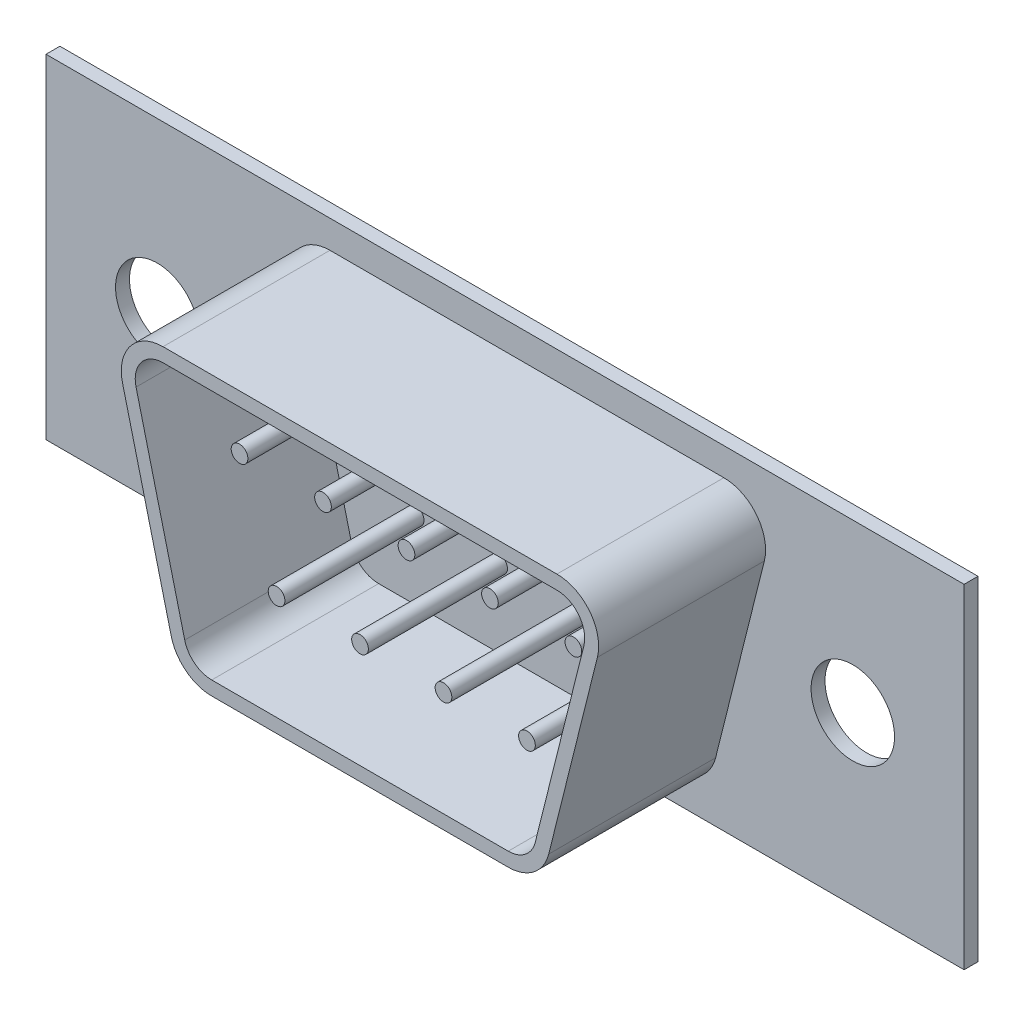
ISO-10303-21;
HEADER;
FILE_DESCRIPTION(('STEP AP214'),'2;1');
FILE_NAME('part.step','',(''),(''),'','','');
FILE_SCHEMA(('AUTOMOTIVE_DESIGN { 1 0 10303 214 1 1 1 1 }'));
ENDSEC;
DATA;
#1=APPLICATION_CONTEXT('core data for automotive mechanical design processes');
#2=APPLICATION_PROTOCOL_DEFINITION('international standard','automotive_design',2000,#1);
#3=PRODUCT_CONTEXT('',#1,'mechanical');
#4=PRODUCT('Part','Part','',(#3));
#5=PRODUCT_RELATED_PRODUCT_CATEGORY('part','',(#4));
#6=PRODUCT_DEFINITION_FORMATION('','',#4);
#7=PRODUCT_DEFINITION_CONTEXT('part definition',#1,'design');
#8=PRODUCT_DEFINITION('design','',#6,#7);
#9=PRODUCT_DEFINITION_SHAPE('','',#8);
#10=(LENGTH_UNIT() NAMED_UNIT(*) SI_UNIT(.MILLI.,.METRE.));
#11=(NAMED_UNIT(*) PLANE_ANGLE_UNIT() SI_UNIT($,.RADIAN.));
#12=(NAMED_UNIT(*) SI_UNIT($,.STERADIAN.) SOLID_ANGLE_UNIT());
#13=UNCERTAINTY_MEASURE_WITH_UNIT(LENGTH_MEASURE(1.E-05),#10,'distance_accuracy_value','');
#14=(GEOMETRIC_REPRESENTATION_CONTEXT(3) GLOBAL_UNCERTAINTY_ASSIGNED_CONTEXT((#13)) GLOBAL_UNIT_ASSIGNED_CONTEXT((#10,
#11,#12)) REPRESENTATION_CONTEXT('',''));
#15=CARTESIAN_POINT('',(0.,0.,0.));
#16=DIRECTION('',(0.,0.,1.));
#17=DIRECTION('',(1.,0.,0.));
#18=AXIS2_PLACEMENT_3D('',#15,#16,#17);
#19=CARTESIAN_POINT('',(16.5,6.,0.5));
#20=DIRECTION('',(0.,0.,-1.));
#21=DIRECTION('',(-1.,0.,0.));
#22=AXIS2_PLACEMENT_3D('',#19,#20,#21);
#23=PLANE('',#22);
#24=CARTESIAN_POINT('',(2.78768063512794,-1.72088537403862,0.5));
#25=DIRECTION('',(0.,0.,-1.));
#26=DIRECTION('',(-1.,0.,0.));
#27=AXIS2_PLACEMENT_3D('',#24,#25,#26);
#28=CIRCLE('',#27,0.3);
#29=CARTESIAN_POINT('',(2.48768063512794,-1.72088537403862,0.5));
#30=VERTEX_POINT('',#29);
#31=EDGE_CURVE('E39',#30,#30,#28,.F.);
#32=ORIENTED_EDGE('',*,*,#31,.F.);
#33=EDGE_LOOP('',(#32));
#34=FACE_BOUND('',#33,.T.);
#35=CARTESIAN_POINT('',(-3.21231936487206,-1.72088537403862,0.5));
#36=DIRECTION('',(0.,0.,-1.));
#37=DIRECTION('',(-1.,0.,0.));
#38=AXIS2_PLACEMENT_3D('',#35,#36,#37);
#39=CIRCLE('',#38,0.3);
#40=CARTESIAN_POINT('',(-3.51231936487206,-1.72088537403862,0.5));
#41=VERTEX_POINT('',#40);
#42=EDGE_CURVE('E286',#41,#41,#39,.F.);
#43=ORIENTED_EDGE('',*,*,#42,.F.);
#44=EDGE_LOOP('',(#43));
#45=FACE_BOUND('',#44,.T.);
#46=CARTESIAN_POINT('',(4.45686261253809,2.04211731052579,0.5));
#47=DIRECTION('',(0.,0.,-1.));
#48=DIRECTION('',(-1.,0.,0.));
#49=AXIS2_PLACEMENT_3D('',#46,#47,#48);
#50=CIRCLE('',#49,0.3);
#51=CARTESIAN_POINT('',(4.15686261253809,2.04211731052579,0.5));
#52=VERTEX_POINT('',#51);
#53=EDGE_CURVE('E280',#52,#52,#50,.F.);
#54=ORIENTED_EDGE('',*,*,#53,.F.);
#55=EDGE_LOOP('',(#54));
#56=FACE_BOUND('',#55,.T.);
#57=CARTESIAN_POINT('',(-1.54313738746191,2.04211731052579,0.5));
#58=DIRECTION('',(0.,0.,-1.));
#59=DIRECTION('',(-1.,0.,0.));
#60=AXIS2_PLACEMENT_3D('',#57,#58,#59);
#61=CIRCLE('',#60,0.3);
#62=CARTESIAN_POINT('',(-1.84313738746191,2.04211731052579,0.5));
#63=VERTEX_POINT('',#62);
#64=EDGE_CURVE('E274',#63,#63,#61,.F.);
#65=ORIENTED_EDGE('',*,*,#64,.F.);
#66=EDGE_LOOP('',(#65));
#67=FACE_BOUND('',#66,.T.);
#68=DIRECTION('',(0.242535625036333,0.970142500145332,0.));
#69=VECTOR('',#68,1.);
#70=CARTESIAN_POINT('',(9.14525227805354,4.5,0.5));
#71=LINE('',#70,#69);
#72=CARTESIAN_POINT('',(7.08461837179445,-3.74253562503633,0.5));
#73=VERTEX_POINT('',#72);
#74=CARTESIAN_POINT('',(8.83461837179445,3.25746437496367,0.5));
#75=VERTEX_POINT('',#74);
#76=EDGE_CURVE('E308',#73,#75,#71,.T.);
#77=ORIENTED_EDGE('',*,*,#76,.T.);
#78=CARTESIAN_POINT('',(7.86447587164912,3.5,0.5));
#79=DIRECTION('',(0.,0.,-1.));
#80=DIRECTION('',(-1.,0.,0.));
#81=AXIS2_PLACEMENT_3D('',#78,#79,#80);
#82=CIRCLE('',#81,1.);
#83=CARTESIAN_POINT('',(7.86447587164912,4.5,0.5));
#84=VERTEX_POINT('',#83);
#85=EDGE_CURVE('E227',#75,#84,#82,.F.);
#86=ORIENTED_EDGE('',*,*,#85,.T.);
#87=DIRECTION('',(-1.,0.,0.));
#88=VECTOR('',#87,1.);
#89=CARTESIAN_POINT('',(-7.57397131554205,4.5,0.5));
#90=LINE('',#89,#88);
#91=CARTESIAN_POINT('',(-6.29319490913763,4.5,0.5));
#92=VERTEX_POINT('',#91);
#93=EDGE_CURVE('E835',#84,#92,#90,.T.);
#94=ORIENTED_EDGE('',*,*,#93,.T.);
#95=CARTESIAN_POINT('',(-6.29319490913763,3.5,0.5));
#96=DIRECTION('',(0.,0.,-1.));
#97=DIRECTION('',(-1.,0.,0.));
#98=AXIS2_PLACEMENT_3D('',#95,#96,#97);
#99=CIRCLE('',#98,1.);
#100=CARTESIAN_POINT('',(-7.26333740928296,3.25746437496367,0.5));
#101=VERTEX_POINT('',#100);
#102=EDGE_CURVE('E206',#92,#101,#99,.F.);
#103=ORIENTED_EDGE('',*,*,#102,.T.);
#104=DIRECTION('',(0.242535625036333,-0.970142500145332,0.));
#105=VECTOR('',#104,1.);
#106=CARTESIAN_POINT('',(-5.32397131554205,-4.5,0.5));
#107=LINE('',#106,#105);
#108=CARTESIAN_POINT('',(-5.51333740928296,-3.74253562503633,0.5));
#109=VERTEX_POINT('',#108);
#110=EDGE_CURVE('E836',#101,#109,#107,.T.);
#111=ORIENTED_EDGE('',*,*,#110,.T.);
#112=CARTESIAN_POINT('',(-4.54319490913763,-3.5,0.5));
#113=DIRECTION('',(0.,0.,-1.));
#114=DIRECTION('',(-1.,0.,0.));
#115=AXIS2_PLACEMENT_3D('',#112,#113,#114);
#116=CIRCLE('',#115,1.);
#117=CARTESIAN_POINT('',(-4.54319490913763,-4.5,0.5));
#118=VERTEX_POINT('',#117);
#119=EDGE_CURVE('E199',#109,#118,#116,.F.);
#120=ORIENTED_EDGE('',*,*,#119,.T.);
#121=DIRECTION('',(1.,0.,0.));
#122=VECTOR('',#121,1.);
#123=CARTESIAN_POINT('',(6.89525227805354,-4.5,0.5));
#124=LINE('',#123,#122);
#125=CARTESIAN_POINT('',(6.11447587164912,-4.5,0.5));
#126=VERTEX_POINT('',#125);
#127=EDGE_CURVE('E830',#118,#126,#124,.T.);
#128=ORIENTED_EDGE('',*,*,#127,.T.);
#129=CARTESIAN_POINT('',(6.11447587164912,-3.5,0.5));
#130=DIRECTION('',(0.,0.,-1.));
#131=DIRECTION('',(-1.,0.,0.));
#132=AXIS2_PLACEMENT_3D('',#129,#130,#131);
#133=CIRCLE('',#132,1.);
#134=EDGE_CURVE('E225',#126,#73,#133,.F.);
#135=ORIENTED_EDGE('',*,*,#134,.T.);
#136=EDGE_LOOP('',(#77,#86,#94,#103,#111,#120,#128,#135));
#137=FACE_BOUND('',#136,.T.);
#138=CARTESIAN_POINT('',(-4.54313738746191,2.04211731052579,0.5));
#139=DIRECTION('',(0.,0.,-1.));
#140=DIRECTION('',(-1.,0.,0.));
#141=AXIS2_PLACEMENT_3D('',#138,#139,#140);
#142=CIRCLE('',#141,0.3);
#143=CARTESIAN_POINT('',(-4.84313738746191,2.04211731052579,0.5));
#144=VERTEX_POINT('',#143);
#145=EDGE_CURVE('E271',#144,#144,#142,.F.);
#146=ORIENTED_EDGE('',*,*,#145,.F.);
#147=EDGE_LOOP('',(#146));
#148=FACE_BOUND('',#147,.T.);
#149=CARTESIAN_POINT('',(1.45686261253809,2.04211731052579,0.5));
#150=DIRECTION('',(0.,0.,-1.));
#151=DIRECTION('',(-1.,0.,0.));
#152=AXIS2_PLACEMENT_3D('',#149,#150,#151);
#153=CIRCLE('',#152,0.3);
#154=CARTESIAN_POINT('',(1.15686261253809,2.04211731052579,0.5));
#155=VERTEX_POINT('',#154);
#156=EDGE_CURVE('E277',#155,#155,#153,.F.);
#157=ORIENTED_EDGE('',*,*,#156,.F.);
#158=EDGE_LOOP('',(#157));
#159=FACE_BOUND('',#158,.T.);
#160=CARTESIAN_POINT('',(7.45686261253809,2.04211731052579,0.5));
#161=DIRECTION('',(0.,0.,-1.));
#162=DIRECTION('',(-1.,0.,0.));
#163=AXIS2_PLACEMENT_3D('',#160,#161,#162);
#164=CIRCLE('',#163,0.3);
#165=CARTESIAN_POINT('',(7.15686261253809,2.04211731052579,0.5));
#166=VERTEX_POINT('',#165);
#167=EDGE_CURVE('E283',#166,#166,#164,.F.);
#168=ORIENTED_EDGE('',*,*,#167,.F.);
#169=EDGE_LOOP('',(#168));
#170=FACE_BOUND('',#169,.T.);
#171=CARTESIAN_POINT('',(-0.212319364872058,-1.72088537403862,0.5));
#172=DIRECTION('',(0.,0.,-1.));
#173=DIRECTION('',(-1.,0.,0.));
#174=AXIS2_PLACEMENT_3D('',#171,#172,#173);
#175=CIRCLE('',#174,0.3);
#176=CARTESIAN_POINT('',(-0.512319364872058,-1.72088537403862,0.5));
#177=VERTEX_POINT('',#176);
#178=EDGE_CURVE('E289',#177,#177,#175,.F.);
#179=ORIENTED_EDGE('',*,*,#178,.F.);
#180=EDGE_LOOP('',(#179));
#181=FACE_BOUND('',#180,.T.);
#182=CARTESIAN_POINT('',(5.78768063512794,-1.72088537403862,0.5));
#183=DIRECTION('',(0.,0.,-1.));
#184=DIRECTION('',(-1.,0.,0.));
#185=AXIS2_PLACEMENT_3D('',#182,#183,#184);
#186=CIRCLE('',#185,0.3);
#187=CARTESIAN_POINT('',(5.48768063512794,-1.72088537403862,0.5));
#188=VERTEX_POINT('',#187);
#189=EDGE_CURVE('E11',#188,#188,#186,.F.);
#190=ORIENTED_EDGE('',*,*,#189,.F.);
#191=EDGE_LOOP('',(#190));
#192=FACE_BOUND('',#191,.T.);
#193=ADVANCED_FACE('F31',(#34,#45,#56,#67,#137,#148,#159,#170,#181,#192),#23,.F.);
#194=CARTESIAN_POINT('',(-12.5,0.,0.5));
#195=DIRECTION('',(0.,0.,1.));
#196=DIRECTION('',(1.,0.,0.));
#197=AXIS2_PLACEMENT_3D('',#194,#195,#196);
#198=CIRCLE('',#197,1.5);
#199=CARTESIAN_POINT('',(-11.,0.,0.5));
#200=VERTEX_POINT('',#199);
#201=EDGE_CURVE('E524',#200,#200,#198,.T.);
#202=ORIENTED_EDGE('',*,*,#201,.F.);
#203=EDGE_LOOP('',(#202));
#204=FACE_BOUND('',#203,.T.);
#205=DIRECTION('',(0.,1.,0.));
#206=VECTOR('',#205,1.);
#207=CARTESIAN_POINT('',(16.5,-6.,0.5));
#208=LINE('',#207,#206);
#209=CARTESIAN_POINT('',(16.5,-6.,0.5));
#210=VERTEX_POINT('',#209);
#211=CARTESIAN_POINT('',(16.5,6.,0.5));
#212=VERTEX_POINT('',#211);
#213=EDGE_CURVE('E181',#210,#212,#208,.T.);
#214=ORIENTED_EDGE('',*,*,#213,.T.);
#215=DIRECTION('',(-1.,0.,0.));
#216=VECTOR('',#215,1.);
#217=CARTESIAN_POINT('',(-16.5,6.,0.5));
#218=LINE('',#217,#216);
#219=CARTESIAN_POINT('',(-16.5,6.,0.5));
#220=VERTEX_POINT('',#219);
#221=EDGE_CURVE('E170',#212,#220,#218,.T.);
#222=ORIENTED_EDGE('',*,*,#221,.T.);
#223=DIRECTION('',(0.,-1.,0.));
#224=VECTOR('',#223,1.);
#225=CARTESIAN_POINT('',(-16.5,-6.,0.5));
#226=LINE('',#225,#224);
#227=CARTESIAN_POINT('',(-16.5,-6.,0.5));
#228=VERTEX_POINT('',#227);
#229=EDGE_CURVE('E180',#220,#228,#226,.T.);
#230=ORIENTED_EDGE('',*,*,#229,.T.);
#231=DIRECTION('',(1.,0.,0.));
#232=VECTOR('',#231,1.);
#233=CARTESIAN_POINT('',(-16.5,-6.,0.5));
#234=LINE('',#233,#232);
#235=EDGE_CURVE('E187',#228,#210,#234,.T.);
#236=ORIENTED_EDGE('',*,*,#235,.T.);
#237=EDGE_LOOP('',(#214,#222,#230,#236));
#238=FACE_BOUND('',#237,.T.);
#239=CARTESIAN_POINT('',(12.5,0.,0.5));
#240=DIRECTION('',(0.,0.,1.));
#241=DIRECTION('',(1.,0.,0.));
#242=AXIS2_PLACEMENT_3D('',#239,#240,#241);
#243=CIRCLE('',#242,1.5);
#244=CARTESIAN_POINT('',(14.,0.,0.5));
#245=VERTEX_POINT('',#244);
#246=EDGE_CURVE('E518',#245,#245,#243,.T.);
#247=ORIENTED_EDGE('',*,*,#246,.F.);
#248=EDGE_LOOP('',(#247));
#249=FACE_BOUND('',#248,.T.);
#250=DIRECTION('',(0.242535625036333,-0.970142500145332,0.));
#251=VECTOR('',#250,1.);
#252=CARTESIAN_POINT('',(-5.71435951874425,-5.,0.5));
#253=LINE('',#252,#251);
#254=CARTESIAN_POINT('',(-7.74840865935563,3.1361965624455,0.5));
#255=VERTEX_POINT('',#254);
#256=CARTESIAN_POINT('',(-5.99840865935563,-3.8638034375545,0.5));
#257=VERTEX_POINT('',#256);
#258=EDGE_CURVE('E508',#255,#257,#253,.T.);
#259=ORIENTED_EDGE('',*,*,#258,.F.);
#260=CARTESIAN_POINT('',(-6.29319490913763,3.5,0.5));
#261=DIRECTION('',(0.,0.,-1.));
#262=DIRECTION('',(-1.,0.,0.));
#263=AXIS2_PLACEMENT_3D('',#260,#261,#262);
#264=CIRCLE('',#263,1.5);
#265=CARTESIAN_POINT('',(-6.29319490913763,5.,0.5));
#266=VERTEX_POINT('',#265);
#267=EDGE_CURVE('E54',#255,#266,#264,.T.);
#268=ORIENTED_EDGE('',*,*,#267,.T.);
#269=DIRECTION('',(-1.,0.,0.));
#270=VECTOR('',#269,1.);
#271=CARTESIAN_POINT('',(-8.21435951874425,5.,0.5));
#272=LINE('',#271,#270);
#273=CARTESIAN_POINT('',(7.86447587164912,5.,0.5));
#274=VERTEX_POINT('',#273);
#275=EDGE_CURVE('E501',#274,#266,#272,.T.);
#276=ORIENTED_EDGE('',*,*,#275,.F.);
#277=CARTESIAN_POINT('',(7.86447587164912,3.5,0.5));
#278=DIRECTION('',(0.,0.,-1.));
#279=DIRECTION('',(-1.,0.,0.));
#280=AXIS2_PLACEMENT_3D('',#277,#278,#279);
#281=CIRCLE('',#280,1.5);
#282=CARTESIAN_POINT('',(9.31968962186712,3.1361965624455,0.5));
#283=VERTEX_POINT('',#282);
#284=EDGE_CURVE('E265',#274,#283,#281,.T.);
#285=ORIENTED_EDGE('',*,*,#284,.T.);
#286=DIRECTION('',(0.242535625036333,0.970142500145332,0.));
#287=VECTOR('',#286,1.);
#288=CARTESIAN_POINT('',(9.78564048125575,5.,0.5));
#289=LINE('',#288,#287);
#290=CARTESIAN_POINT('',(7.56968962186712,-3.8638034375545,0.5));
#291=VERTEX_POINT('',#290);
#292=EDGE_CURVE('E513',#291,#283,#289,.T.);
#293=ORIENTED_EDGE('',*,*,#292,.F.);
#294=CARTESIAN_POINT('',(6.11447587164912,-3.5,0.5));
#295=DIRECTION('',(0.,0.,-1.));
#296=DIRECTION('',(-1.,0.,0.));
#297=AXIS2_PLACEMENT_3D('',#294,#295,#296);
#298=CIRCLE('',#297,1.5);
#299=CARTESIAN_POINT('',(6.11447587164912,-5.,0.5));
#300=VERTEX_POINT('',#299);
#301=EDGE_CURVE('E267',#291,#300,#298,.T.);
#302=ORIENTED_EDGE('',*,*,#301,.T.);
#303=DIRECTION('',(1.,0.,0.));
#304=VECTOR('',#303,1.);
#305=CARTESIAN_POINT('',(7.28564048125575,-5.,0.5));
#306=LINE('',#305,#304);
#307=CARTESIAN_POINT('',(-4.54319490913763,-5.,0.5));
#308=VERTEX_POINT('',#307);
#309=EDGE_CURVE('E510',#308,#300,#306,.T.);
#310=ORIENTED_EDGE('',*,*,#309,.F.);
#311=CARTESIAN_POINT('',(-4.54319490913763,-3.5,0.5));
#312=DIRECTION('',(0.,0.,-1.));
#313=DIRECTION('',(-1.,0.,0.));
#314=AXIS2_PLACEMENT_3D('',#311,#312,#313);
#315=CIRCLE('',#314,1.5);
#316=EDGE_CURVE('E46',#308,#257,#315,.T.);
#317=ORIENTED_EDGE('',*,*,#316,.T.);
#318=EDGE_LOOP('',(#259,#268,#276,#285,#293,#302,#310,#317));
#319=FACE_BOUND('',#318,.T.);
#320=ADVANCED_FACE('F184',(#204,#238,#249,#319),#23,.F.);
#321=CARTESIAN_POINT('',(16.5,6.,0.));
#322=DIRECTION('',(0.,0.,-1.));
#323=DIRECTION('',(-1.,0.,0.));
#324=AXIS2_PLACEMENT_3D('',#321,#322,#323);
#325=PLANE('',#324);
#326=CARTESIAN_POINT('',(-12.5,0.,0.));
#327=DIRECTION('',(0.,0.,1.));
#328=DIRECTION('',(1.,0.,0.));
#329=AXIS2_PLACEMENT_3D('',#326,#327,#328);
#330=CIRCLE('',#329,1.5);
#331=CARTESIAN_POINT('',(-11.,0.,0.));
#332=VERTEX_POINT('',#331);
#333=EDGE_CURVE('E521',#332,#332,#330,.T.);
#334=ORIENTED_EDGE('',*,*,#333,.T.);
#335=EDGE_LOOP('',(#334));
#336=FACE_BOUND('',#335,.T.);
#337=DIRECTION('',(0.,1.,0.));
#338=VECTOR('',#337,1.);
#339=CARTESIAN_POINT('',(16.5,-6.,0.));
#340=LINE('',#339,#338);
#341=CARTESIAN_POINT('',(16.5,-6.,0.));
#342=VERTEX_POINT('',#341);
#343=CARTESIAN_POINT('',(16.5,6.,0.));
#344=VERTEX_POINT('',#343);
#345=EDGE_CURVE('E195',#342,#344,#340,.T.);
#346=ORIENTED_EDGE('',*,*,#345,.F.);
#347=DIRECTION('',(1.,0.,0.));
#348=VECTOR('',#347,1.);
#349=CARTESIAN_POINT('',(-16.5,-6.,0.));
#350=LINE('',#349,#348);
#351=CARTESIAN_POINT('',(-16.5,-6.,0.));
#352=VERTEX_POINT('',#351);
#353=EDGE_CURVE('E191',#352,#342,#350,.T.);
#354=ORIENTED_EDGE('',*,*,#353,.F.);
#355=DIRECTION('',(0.,-1.,0.));
#356=VECTOR('',#355,1.);
#357=CARTESIAN_POINT('',(-16.5,-6.,0.));
#358=LINE('',#357,#356);
#359=CARTESIAN_POINT('',(-16.5,6.,0.));
#360=VERTEX_POINT('',#359);
#361=EDGE_CURVE('E535',#360,#352,#358,.T.);
#362=ORIENTED_EDGE('',*,*,#361,.F.);
#363=DIRECTION('',(-1.,0.,0.));
#364=VECTOR('',#363,1.);
#365=CARTESIAN_POINT('',(-16.5,6.,0.));
#366=LINE('',#365,#364);
#367=EDGE_CURVE('E533',#344,#360,#366,.T.);
#368=ORIENTED_EDGE('',*,*,#367,.F.);
#369=EDGE_LOOP('',(#346,#354,#362,#368));
#370=FACE_BOUND('',#369,.T.);
#371=CARTESIAN_POINT('',(12.5,0.,0.));
#372=DIRECTION('',(0.,0.,1.));
#373=DIRECTION('',(1.,0.,0.));
#374=AXIS2_PLACEMENT_3D('',#371,#372,#373);
#375=CIRCLE('',#374,1.5);
#376=CARTESIAN_POINT('',(14.,0.,0.));
#377=VERTEX_POINT('',#376);
#378=EDGE_CURVE('E507',#377,#377,#375,.T.);
#379=ORIENTED_EDGE('',*,*,#378,.T.);
#380=EDGE_LOOP('',(#379));
#381=FACE_BOUND('',#380,.T.);
#382=ADVANCED_FACE('F440',(#336,#370,#381),#325,.T.);
#383=CARTESIAN_POINT('',(16.5,-6.,0.5));
#384=DIRECTION('',(-1.,0.,0.));
#385=DIRECTION('',(0.,0.,1.));
#386=AXIS2_PLACEMENT_3D('',#383,#384,#385);
#387=PLANE('',#386);
#388=ORIENTED_EDGE('',*,*,#345,.T.);
#389=DIRECTION('',(0.,0.,-1.));
#390=VECTOR('',#389,1.);
#391=CARTESIAN_POINT('',(16.5,6.,0.5));
#392=LINE('',#391,#390);
#393=EDGE_CURVE('E174',#212,#344,#392,.T.);
#394=ORIENTED_EDGE('',*,*,#393,.F.);
#395=ORIENTED_EDGE('',*,*,#213,.F.);
#396=DIRECTION('',(0.,0.,-1.));
#397=VECTOR('',#396,1.);
#398=CARTESIAN_POINT('',(16.5,-6.,0.5));
#399=LINE('',#398,#397);
#400=EDGE_CURVE('E531',#210,#342,#399,.T.);
#401=ORIENTED_EDGE('',*,*,#400,.T.);
#402=EDGE_LOOP('',(#388,#394,#395,#401));
#403=FACE_BOUND('',#402,.T.);
#404=ADVANCED_FACE('F193',(#403),#387,.F.);
#405=CARTESIAN_POINT('',(-16.5,6.,0.5));
#406=DIRECTION('',(0.,-1.,0.));
#407=DIRECTION('',(0.,0.,-1.));
#408=AXIS2_PLACEMENT_3D('',#405,#406,#407);
#409=PLANE('',#408);
#410=ORIENTED_EDGE('',*,*,#367,.T.);
#411=DIRECTION('',(0.,0.,-1.));
#412=VECTOR('',#411,1.);
#413=CARTESIAN_POINT('',(-16.5,6.,0.5));
#414=LINE('',#413,#412);
#415=EDGE_CURVE('E177',#220,#360,#414,.T.);
#416=ORIENTED_EDGE('',*,*,#415,.F.);
#417=ORIENTED_EDGE('',*,*,#221,.F.);
#418=ORIENTED_EDGE('',*,*,#393,.T.);
#419=EDGE_LOOP('',(#410,#416,#417,#418));
#420=FACE_BOUND('',#419,.T.);
#421=ADVANCED_FACE('F172',(#420),#409,.F.);
#422=CARTESIAN_POINT('',(-16.5,-6.,0.5));
#423=DIRECTION('',(1.,0.,0.));
#424=DIRECTION('',(0.,0.,-1.));
#425=AXIS2_PLACEMENT_3D('',#422,#423,#424);
#426=PLANE('',#425);
#427=ORIENTED_EDGE('',*,*,#361,.T.);
#428=DIRECTION('',(0.,0.,-1.));
#429=VECTOR('',#428,1.);
#430=CARTESIAN_POINT('',(-16.5,-6.,0.5));
#431=LINE('',#430,#429);
#432=EDGE_CURVE('E201',#228,#352,#431,.T.);
#433=ORIENTED_EDGE('',*,*,#432,.F.);
#434=ORIENTED_EDGE('',*,*,#229,.F.);
#435=ORIENTED_EDGE('',*,*,#415,.T.);
#436=EDGE_LOOP('',(#427,#433,#434,#435));
#437=FACE_BOUND('',#436,.T.);
#438=ADVANCED_FACE('F446',(#437),#426,.F.);
#439=CARTESIAN_POINT('',(-16.5,-6.,0.5));
#440=DIRECTION('',(0.,1.,0.));
#441=DIRECTION('',(0.,0.,1.));
#442=AXIS2_PLACEMENT_3D('',#439,#440,#441);
#443=PLANE('',#442);
#444=ORIENTED_EDGE('',*,*,#353,.T.);
#445=ORIENTED_EDGE('',*,*,#400,.F.);
#446=ORIENTED_EDGE('',*,*,#235,.F.);
#447=ORIENTED_EDGE('',*,*,#432,.T.);
#448=EDGE_LOOP('',(#444,#445,#446,#447));
#449=FACE_BOUND('',#448,.T.);
#450=ADVANCED_FACE('F437',(#449),#443,.F.);
#451=CARTESIAN_POINT('',(-12.5,0.,0.5));
#452=DIRECTION('',(0.,0.,-1.));
#453=DIRECTION('',(-1.,0.,0.));
#454=AXIS2_PLACEMENT_3D('',#451,#452,#453);
#455=CYLINDRICAL_SURFACE('',#454,1.5);
#456=ORIENTED_EDGE('',*,*,#201,.T.);
#457=EDGE_LOOP('',(#456));
#458=FACE_BOUND('',#457,.T.);
#459=ORIENTED_EDGE('',*,*,#333,.F.);
#460=EDGE_LOOP('',(#459));
#461=FACE_BOUND('',#460,.T.);
#462=ADVANCED_FACE('F434',(#458,#461),#455,.F.);
#463=CARTESIAN_POINT('',(12.5,0.,0.5));
#464=DIRECTION('',(0.,0.,-1.));
#465=DIRECTION('',(-1.,0.,0.));
#466=AXIS2_PLACEMENT_3D('',#463,#464,#465);
#467=CYLINDRICAL_SURFACE('',#466,1.5);
#468=ORIENTED_EDGE('',*,*,#246,.T.);
#469=EDGE_LOOP('',(#468));
#470=FACE_BOUND('',#469,.T.);
#471=ORIENTED_EDGE('',*,*,#378,.F.);
#472=EDGE_LOOP('',(#471));
#473=FACE_BOUND('',#472,.T.);
#474=ADVANCED_FACE('F416',(#470,#473),#467,.F.);
#475=CARTESIAN_POINT('',(-8.21435951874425,5.,6.5));
#476=DIRECTION('',(0.,0.,-1.));
#477=DIRECTION('',(-1.,0.,0.));
#478=AXIS2_PLACEMENT_3D('',#475,#476,#477);
#479=PLANE('',#478);
#480=DIRECTION('',(0.242535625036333,0.970142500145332,0.));
#481=VECTOR('',#480,1.);
#482=CARTESIAN_POINT('',(9.78564048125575,5.,6.5));
#483=LINE('',#482,#481);
#484=CARTESIAN_POINT('',(7.56968962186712,-3.8638034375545,6.5));
#485=VERTEX_POINT('',#484);
#486=CARTESIAN_POINT('',(9.31968962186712,3.1361965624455,6.5));
#487=VERTEX_POINT('',#486);
#488=EDGE_CURVE('E497',#485,#487,#483,.T.);
#489=ORIENTED_EDGE('',*,*,#488,.T.);
#490=CARTESIAN_POINT('',(7.86447587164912,3.5,6.5));
#491=DIRECTION('',(0.,0.,-1.));
#492=DIRECTION('',(-1.,0.,0.));
#493=AXIS2_PLACEMENT_3D('',#490,#491,#492);
#494=CIRCLE('',#493,1.5);
#495=CARTESIAN_POINT('',(7.86447587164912,5.,6.5));
#496=VERTEX_POINT('',#495);
#497=EDGE_CURVE('E254',#487,#496,#494,.F.);
#498=ORIENTED_EDGE('',*,*,#497,.T.);
#499=DIRECTION('',(-1.,0.,0.));
#500=VECTOR('',#499,1.);
#501=CARTESIAN_POINT('',(-8.21435951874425,5.,6.5));
#502=LINE('',#501,#500);
#503=CARTESIAN_POINT('',(-6.29319490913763,5.,6.5));
#504=VERTEX_POINT('',#503);
#505=EDGE_CURVE('E499',#496,#504,#502,.T.);
#506=ORIENTED_EDGE('',*,*,#505,.T.);
#507=CARTESIAN_POINT('',(-6.29319490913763,3.5,6.5));
#508=DIRECTION('',(0.,0.,-1.));
#509=DIRECTION('',(-1.,0.,0.));
#510=AXIS2_PLACEMENT_3D('',#507,#508,#509);
#511=CIRCLE('',#510,1.5);
#512=CARTESIAN_POINT('',(-7.74840865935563,3.1361965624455,6.5));
#513=VERTEX_POINT('',#512);
#514=EDGE_CURVE('E248',#504,#513,#511,.F.);
#515=ORIENTED_EDGE('',*,*,#514,.T.);
#516=DIRECTION('',(0.242535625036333,-0.970142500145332,0.));
#517=VECTOR('',#516,1.);
#518=CARTESIAN_POINT('',(-5.71435951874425,-5.,6.5));
#519=LINE('',#518,#517);
#520=CARTESIAN_POINT('',(-5.99840865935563,-3.8638034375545,6.5));
#521=VERTEX_POINT('',#520);
#522=EDGE_CURVE('E494',#513,#521,#519,.T.);
#523=ORIENTED_EDGE('',*,*,#522,.T.);
#524=CARTESIAN_POINT('',(-4.54319490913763,-3.5,6.5));
#525=DIRECTION('',(0.,0.,-1.));
#526=DIRECTION('',(-1.,0.,0.));
#527=AXIS2_PLACEMENT_3D('',#524,#525,#526);
#528=CIRCLE('',#527,1.5);
#529=CARTESIAN_POINT('',(-4.54319490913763,-5.,6.5));
#530=VERTEX_POINT('',#529);
#531=EDGE_CURVE('E250',#521,#530,#528,.F.);
#532=ORIENTED_EDGE('',*,*,#531,.T.);
#533=DIRECTION('',(1.,0.,0.));
#534=VECTOR('',#533,1.);
#535=CARTESIAN_POINT('',(7.28564048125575,-5.,6.5));
#536=LINE('',#535,#534);
#537=CARTESIAN_POINT('',(6.11447587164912,-5.,6.5));
#538=VERTEX_POINT('',#537);
#539=EDGE_CURVE('E491',#530,#538,#536,.T.);
#540=ORIENTED_EDGE('',*,*,#539,.T.);
#541=CARTESIAN_POINT('',(6.11447587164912,-3.5,6.5));
#542=DIRECTION('',(0.,0.,-1.));
#543=DIRECTION('',(-1.,0.,0.));
#544=AXIS2_PLACEMENT_3D('',#541,#542,#543);
#545=CIRCLE('',#544,1.5);
#546=EDGE_CURVE('E252',#538,#485,#545,.F.);
#547=ORIENTED_EDGE('',*,*,#546,.T.);
#548=EDGE_LOOP('',(#489,#498,#506,#515,#523,#532,#540,#547));
#549=FACE_BOUND('',#548,.T.);
#550=DIRECTION('',(1.,0.,0.));
#551=VECTOR('',#550,1.);
#552=CARTESIAN_POINT('',(6.89525227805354,-4.5,6.5));
#553=LINE('',#552,#551);
#554=CARTESIAN_POINT('',(-4.54319490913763,-4.5,6.5));
#555=VERTEX_POINT('',#554);
#556=CARTESIAN_POINT('',(6.11447587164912,-4.5,6.5));
#557=VERTEX_POINT('',#556);
#558=EDGE_CURVE('E838',#555,#557,#553,.T.);
#559=ORIENTED_EDGE('',*,*,#558,.F.);
#560=CARTESIAN_POINT('',(-4.54319490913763,-3.5,6.5));
#561=DIRECTION('',(0.,0.,-1.));
#562=DIRECTION('',(-1.,0.,0.));
#563=AXIS2_PLACEMENT_3D('',#560,#561,#562);
#564=CIRCLE('',#563,1.);
#565=CARTESIAN_POINT('',(-5.51333740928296,-3.74253562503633,6.5));
#566=VERTEX_POINT('',#565);
#567=EDGE_CURVE('E218',#555,#566,#564,.T.);
#568=ORIENTED_EDGE('',*,*,#567,.T.);
#569=DIRECTION('',(0.242535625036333,-0.970142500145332,0.));
#570=VECTOR('',#569,1.);
#571=CARTESIAN_POINT('',(-5.32397131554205,-4.5,6.5));
#572=LINE('',#571,#570);
#573=CARTESIAN_POINT('',(-7.26333740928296,3.25746437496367,6.5));
#574=VERTEX_POINT('',#573);
#575=EDGE_CURVE('E511',#574,#566,#572,.T.);
#576=ORIENTED_EDGE('',*,*,#575,.F.);
#577=CARTESIAN_POINT('',(-6.29319490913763,3.5,6.5));
#578=DIRECTION('',(0.,0.,-1.));
#579=DIRECTION('',(-1.,0.,0.));
#580=AXIS2_PLACEMENT_3D('',#577,#578,#579);
#581=CIRCLE('',#580,1.);
#582=CARTESIAN_POINT('',(-6.29319490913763,4.5,6.5));
#583=VERTEX_POINT('',#582);
#584=EDGE_CURVE('E215',#574,#583,#581,.T.);
#585=ORIENTED_EDGE('',*,*,#584,.T.);
#586=DIRECTION('',(-1.,0.,0.));
#587=VECTOR('',#586,1.);
#588=CARTESIAN_POINT('',(-7.57397131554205,4.5,6.5));
#589=LINE('',#588,#587);
#590=CARTESIAN_POINT('',(7.86447587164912,4.5,6.5));
#591=VERTEX_POINT('',#590);
#592=EDGE_CURVE('E822',#591,#583,#589,.T.);
#593=ORIENTED_EDGE('',*,*,#592,.F.);
#594=CARTESIAN_POINT('',(7.86447587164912,3.5,6.5));
#595=DIRECTION('',(0.,0.,-1.));
#596=DIRECTION('',(-1.,0.,0.));
#597=AXIS2_PLACEMENT_3D('',#594,#595,#596);
#598=CIRCLE('',#597,1.);
#599=CARTESIAN_POINT('',(8.83461837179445,3.25746437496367,6.5));
#600=VERTEX_POINT('',#599);
#601=EDGE_CURVE('E234',#591,#600,#598,.T.);
#602=ORIENTED_EDGE('',*,*,#601,.T.);
#603=DIRECTION('',(0.242535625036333,0.970142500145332,0.));
#604=VECTOR('',#603,1.);
#605=CARTESIAN_POINT('',(9.14525227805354,4.5,6.5));
#606=LINE('',#605,#604);
#607=CARTESIAN_POINT('',(7.08461837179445,-3.74253562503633,6.5));
#608=VERTEX_POINT('',#607);
#609=EDGE_CURVE('E826',#608,#600,#606,.T.);
#610=ORIENTED_EDGE('',*,*,#609,.F.);
#611=CARTESIAN_POINT('',(6.11447587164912,-3.5,6.5));
#612=DIRECTION('',(0.,0.,-1.));
#613=DIRECTION('',(-1.,0.,0.));
#614=AXIS2_PLACEMENT_3D('',#611,#612,#613);
#615=CIRCLE('',#614,1.);
#616=EDGE_CURVE('E236',#608,#557,#615,.T.);
#617=ORIENTED_EDGE('',*,*,#616,.T.);
#618=EDGE_LOOP('',(#559,#568,#576,#585,#593,#602,#610,#617));
#619=FACE_BOUND('',#618,.T.);
#620=ADVANCED_FACE('F412',(#549,#619),#479,.F.);
#621=CARTESIAN_POINT('',(-5.71435951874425,-5.,6.5));
#622=DIRECTION('',(0.970142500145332,0.242535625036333,0.));
#623=DIRECTION('',(-0.242535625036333,0.970142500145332,0.));
#624=AXIS2_PLACEMENT_3D('',#621,#622,#623);
#625=PLANE('',#624);
#626=ORIENTED_EDGE('',*,*,#258,.T.);
#627=DIRECTION('',(0.,0.,-1.));
#628=VECTOR('',#627,1.);
#629=CARTESIAN_POINT('',(-5.99840865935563,-3.8638034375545,6.5));
#630=LINE('',#629,#628);
#631=EDGE_CURVE('E263',#257,#521,#630,.F.);
#632=ORIENTED_EDGE('',*,*,#631,.T.);
#633=ORIENTED_EDGE('',*,*,#522,.F.);
#634=DIRECTION('',(0.,0.,-1.));
#635=VECTOR('',#634,1.);
#636=CARTESIAN_POINT('',(-7.74840865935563,3.1361965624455,6.5));
#637=LINE('',#636,#635);
#638=EDGE_CURVE('E261',#513,#255,#637,.T.);
#639=ORIENTED_EDGE('',*,*,#638,.T.);
#640=EDGE_LOOP('',(#626,#632,#633,#639));
#641=FACE_BOUND('',#640,.T.);
#642=ADVANCED_FACE('F415',(#641),#625,.F.);
#643=CARTESIAN_POINT('',(7.28564048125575,-5.,6.5));
#644=DIRECTION('',(0.,1.,0.));
#645=DIRECTION('',(-1.,0.,0.));
#646=AXIS2_PLACEMENT_3D('',#643,#644,#645);
#647=PLANE('',#646);
#648=ORIENTED_EDGE('',*,*,#309,.T.);
#649=DIRECTION('',(0.,0.,-1.));
#650=VECTOR('',#649,1.);
#651=CARTESIAN_POINT('',(6.11447587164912,-5.,6.5));
#652=LINE('',#651,#650);
#653=EDGE_CURVE('E259',#300,#538,#652,.F.);
#654=ORIENTED_EDGE('',*,*,#653,.T.);
#655=ORIENTED_EDGE('',*,*,#539,.F.);
#656=DIRECTION('',(0.,0.,-1.));
#657=VECTOR('',#656,1.);
#658=CARTESIAN_POINT('',(-4.54319490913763,-5.,6.5));
#659=LINE('',#658,#657);
#660=EDGE_CURVE('E256',#530,#308,#659,.T.);
#661=ORIENTED_EDGE('',*,*,#660,.T.);
#662=EDGE_LOOP('',(#648,#654,#655,#661));
#663=FACE_BOUND('',#662,.T.);
#664=ADVANCED_FACE('F424',(#663),#647,.F.);
#665=CARTESIAN_POINT('',(9.78564048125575,5.,6.5));
#666=DIRECTION('',(-0.970142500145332,0.242535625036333,0.));
#667=DIRECTION('',(-0.242535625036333,-0.970142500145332,0.));
#668=AXIS2_PLACEMENT_3D('',#665,#666,#667);
#669=PLANE('',#668);
#670=ORIENTED_EDGE('',*,*,#292,.T.);
#671=DIRECTION('',(0.,0.,-1.));
#672=VECTOR('',#671,1.);
#673=CARTESIAN_POINT('',(9.31968962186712,3.1361965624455,6.5));
#674=LINE('',#673,#672);
#675=EDGE_CURVE('E246',#283,#487,#674,.F.);
#676=ORIENTED_EDGE('',*,*,#675,.T.);
#677=ORIENTED_EDGE('',*,*,#488,.F.);
#678=DIRECTION('',(0.,0.,-1.));
#679=VECTOR('',#678,1.);
#680=CARTESIAN_POINT('',(7.56968962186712,-3.8638034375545,6.5));
#681=LINE('',#680,#679);
#682=EDGE_CURVE('E243',#485,#291,#681,.T.);
#683=ORIENTED_EDGE('',*,*,#682,.T.);
#684=EDGE_LOOP('',(#670,#676,#677,#683));
#685=FACE_BOUND('',#684,.T.);
#686=ADVANCED_FACE('F420',(#685),#669,.F.);
#687=CARTESIAN_POINT('',(-8.21435951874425,5.,6.5));
#688=DIRECTION('',(0.,-1.,0.));
#689=DIRECTION('',(0.,0.,-1.));
#690=AXIS2_PLACEMENT_3D('',#687,#688,#689);
#691=PLANE('',#690);
#692=ORIENTED_EDGE('',*,*,#505,.F.);
#693=DIRECTION('',(0.,0.,-1.));
#694=VECTOR('',#693,1.);
#695=CARTESIAN_POINT('',(7.86447587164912,5.,6.5));
#696=LINE('',#695,#694);
#697=EDGE_CURVE('E240',#496,#274,#696,.T.);
#698=ORIENTED_EDGE('',*,*,#697,.T.);
#699=ORIENTED_EDGE('',*,*,#275,.T.);
#700=DIRECTION('',(0.,0.,-1.));
#701=VECTOR('',#700,1.);
#702=CARTESIAN_POINT('',(-6.29319490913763,5.,6.5));
#703=LINE('',#702,#701);
#704=EDGE_CURVE('E238',#266,#504,#703,.F.);
#705=ORIENTED_EDGE('',*,*,#704,.T.);
#706=EDGE_LOOP('',(#692,#698,#699,#705));
#707=FACE_BOUND('',#706,.T.);
#708=ADVANCED_FACE('F410',(#707),#691,.F.);
#709=CARTESIAN_POINT('',(6.89525227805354,-4.5,6.5));
#710=DIRECTION('',(0.,1.,0.));
#711=DIRECTION('',(-1.,0.,0.));
#712=AXIS2_PLACEMENT_3D('',#709,#710,#711);
#713=PLANE('',#712);
#714=ORIENTED_EDGE('',*,*,#558,.T.);
#715=DIRECTION('',(0.,0.,-1.));
#716=VECTOR('',#715,1.);
#717=CARTESIAN_POINT('',(6.11447587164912,-4.5,0.5));
#718=LINE('',#717,#716);
#719=EDGE_CURVE('E231',#557,#126,#718,.T.);
#720=ORIENTED_EDGE('',*,*,#719,.T.);
#721=ORIENTED_EDGE('',*,*,#127,.F.);
#722=DIRECTION('',(0.,0.,-1.));
#723=VECTOR('',#722,1.);
#724=CARTESIAN_POINT('',(-4.54319490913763,-4.5,6.5));
#725=LINE('',#724,#723);
#726=EDGE_CURVE('E213',#118,#555,#725,.F.);
#727=ORIENTED_EDGE('',*,*,#726,.T.);
#728=EDGE_LOOP('',(#714,#720,#721,#727));
#729=FACE_BOUND('',#728,.T.);
#730=ADVANCED_FACE('F406',(#729),#713,.T.);
#731=CARTESIAN_POINT('',(9.14525227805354,4.5,6.5));
#732=DIRECTION('',(-0.970142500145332,0.242535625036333,0.));
#733=DIRECTION('',(-0.242535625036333,-0.970142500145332,0.));
#734=AXIS2_PLACEMENT_3D('',#731,#732,#733);
#735=PLANE('',#734);
#736=ORIENTED_EDGE('',*,*,#609,.T.);
#737=DIRECTION('',(0.,0.,-1.));
#738=VECTOR('',#737,1.);
#739=CARTESIAN_POINT('',(8.83461837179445,3.25746437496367,0.5));
#740=LINE('',#739,#738);
#741=EDGE_CURVE('E222',#600,#75,#740,.T.);
#742=ORIENTED_EDGE('',*,*,#741,.T.);
#743=ORIENTED_EDGE('',*,*,#76,.F.);
#744=DIRECTION('',(0.,0.,-1.));
#745=VECTOR('',#744,1.);
#746=CARTESIAN_POINT('',(7.08461837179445,-3.74253562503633,6.5));
#747=LINE('',#746,#745);
#748=EDGE_CURVE('E220',#73,#608,#747,.F.);
#749=ORIENTED_EDGE('',*,*,#748,.T.);
#750=EDGE_LOOP('',(#736,#742,#743,#749));
#751=FACE_BOUND('',#750,.T.);
#752=ADVANCED_FACE('F402',(#751),#735,.T.);
#753=CARTESIAN_POINT('',(-7.57397131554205,4.5,6.5));
#754=DIRECTION('',(0.,-1.,0.));
#755=DIRECTION('',(0.,0.,-1.));
#756=AXIS2_PLACEMENT_3D('',#753,#754,#755);
#757=PLANE('',#756);
#758=ORIENTED_EDGE('',*,*,#93,.F.);
#759=DIRECTION('',(0.,0.,-1.));
#760=VECTOR('',#759,1.);
#761=CARTESIAN_POINT('',(7.86447587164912,4.5,6.5));
#762=LINE('',#761,#760);
#763=EDGE_CURVE('E229',#84,#591,#762,.F.);
#764=ORIENTED_EDGE('',*,*,#763,.T.);
#765=ORIENTED_EDGE('',*,*,#592,.T.);
#766=DIRECTION('',(0.,0.,-1.));
#767=VECTOR('',#766,1.);
#768=CARTESIAN_POINT('',(-6.29319490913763,4.5,0.5));
#769=LINE('',#768,#767);
#770=EDGE_CURVE('E196',#583,#92,#769,.T.);
#771=ORIENTED_EDGE('',*,*,#770,.T.);
#772=EDGE_LOOP('',(#758,#764,#765,#771));
#773=FACE_BOUND('',#772,.T.);
#774=ADVANCED_FACE('F398',(#773),#757,.T.);
#775=CARTESIAN_POINT('',(-5.32397131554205,-4.5,6.5));
#776=DIRECTION('',(0.970142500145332,0.242535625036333,0.));
#777=DIRECTION('',(-0.242535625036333,0.970142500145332,0.));
#778=AXIS2_PLACEMENT_3D('',#775,#776,#777);
#779=PLANE('',#778);
#780=ORIENTED_EDGE('',*,*,#110,.F.);
#781=DIRECTION('',(0.,0.,-1.));
#782=VECTOR('',#781,1.);
#783=CARTESIAN_POINT('',(-7.26333740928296,3.25746437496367,6.5));
#784=LINE('',#783,#782);
#785=EDGE_CURVE('E211',#101,#574,#784,.F.);
#786=ORIENTED_EDGE('',*,*,#785,.T.);
#787=ORIENTED_EDGE('',*,*,#575,.T.);
#788=DIRECTION('',(0.,0.,-1.));
#789=VECTOR('',#788,1.);
#790=CARTESIAN_POINT('',(-5.51333740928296,-3.74253562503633,0.5));
#791=LINE('',#790,#789);
#792=EDGE_CURVE('E208',#566,#109,#791,.T.);
#793=ORIENTED_EDGE('',*,*,#792,.T.);
#794=EDGE_LOOP('',(#780,#786,#787,#793));
#795=FACE_BOUND('',#794,.T.);
#796=ADVANCED_FACE('F394',(#795),#779,.T.);
#797=CARTESIAN_POINT('',(-6.29319490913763,3.5,6.5));
#798=DIRECTION('',(0.,0.,1.));
#799=DIRECTION('',(1.,0.,0.));
#800=AXIS2_PLACEMENT_3D('',#797,#798,#799);
#801=CYLINDRICAL_SURFACE('',#800,1.);
#802=ORIENTED_EDGE('',*,*,#584,.F.);
#803=ORIENTED_EDGE('',*,*,#785,.F.);
#804=ORIENTED_EDGE('',*,*,#102,.F.);
#805=ORIENTED_EDGE('',*,*,#770,.F.);
#806=EDGE_LOOP('',(#802,#803,#804,#805));
#807=FACE_BOUND('',#806,.T.);
#808=ADVANCED_FACE('F397',(#807),#801,.F.);
#809=CARTESIAN_POINT('',(-4.54319490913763,-3.5,6.5));
#810=DIRECTION('',(0.,0.,1.));
#811=DIRECTION('',(1.,0.,0.));
#812=AXIS2_PLACEMENT_3D('',#809,#810,#811);
#813=CYLINDRICAL_SURFACE('',#812,1.);
#814=ORIENTED_EDGE('',*,*,#567,.F.);
#815=ORIENTED_EDGE('',*,*,#726,.F.);
#816=ORIENTED_EDGE('',*,*,#119,.F.);
#817=ORIENTED_EDGE('',*,*,#792,.F.);
#818=EDGE_LOOP('',(#814,#815,#816,#817));
#819=FACE_BOUND('',#818,.T.);
#820=ADVANCED_FACE('F457',(#819),#813,.F.);
#821=CARTESIAN_POINT('',(7.86447587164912,3.5,6.5));
#822=DIRECTION('',(0.,0.,1.));
#823=DIRECTION('',(1.,0.,0.));
#824=AXIS2_PLACEMENT_3D('',#821,#822,#823);
#825=CYLINDRICAL_SURFACE('',#824,1.);
#826=ORIENTED_EDGE('',*,*,#601,.F.);
#827=ORIENTED_EDGE('',*,*,#763,.F.);
#828=ORIENTED_EDGE('',*,*,#85,.F.);
#829=ORIENTED_EDGE('',*,*,#741,.F.);
#830=EDGE_LOOP('',(#826,#827,#828,#829));
#831=FACE_BOUND('',#830,.T.);
#832=ADVANCED_FACE('F461',(#831),#825,.F.);
#833=CARTESIAN_POINT('',(6.11447587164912,-3.5,6.5));
#834=DIRECTION('',(0.,0.,1.));
#835=DIRECTION('',(1.,0.,0.));
#836=AXIS2_PLACEMENT_3D('',#833,#834,#835);
#837=CYLINDRICAL_SURFACE('',#836,1.);
#838=ORIENTED_EDGE('',*,*,#616,.F.);
#839=ORIENTED_EDGE('',*,*,#748,.F.);
#840=ORIENTED_EDGE('',*,*,#134,.F.);
#841=ORIENTED_EDGE('',*,*,#719,.F.);
#842=EDGE_LOOP('',(#838,#839,#840,#841));
#843=FACE_BOUND('',#842,.T.);
#844=ADVANCED_FACE('F465',(#843),#837,.F.);
#845=CARTESIAN_POINT('',(7.86447587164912,3.5,6.5));
#846=DIRECTION('',(0.,0.,-1.));
#847=DIRECTION('',(-1.,0.,0.));
#848=AXIS2_PLACEMENT_3D('',#845,#846,#847);
#849=CYLINDRICAL_SURFACE('',#848,1.5);
#850=ORIENTED_EDGE('',*,*,#497,.F.);
#851=ORIENTED_EDGE('',*,*,#675,.F.);
#852=ORIENTED_EDGE('',*,*,#284,.F.);
#853=ORIENTED_EDGE('',*,*,#697,.F.);
#854=EDGE_LOOP('',(#850,#851,#852,#853));
#855=FACE_BOUND('',#854,.T.);
#856=ADVANCED_FACE('F469',(#855),#849,.T.);
#857=CARTESIAN_POINT('',(6.11447587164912,-3.5,6.5));
#858=DIRECTION('',(0.,0.,-1.));
#859=DIRECTION('',(-1.,0.,0.));
#860=AXIS2_PLACEMENT_3D('',#857,#858,#859);
#861=CYLINDRICAL_SURFACE('',#860,1.5);
#862=ORIENTED_EDGE('',*,*,#546,.F.);
#863=ORIENTED_EDGE('',*,*,#653,.F.);
#864=ORIENTED_EDGE('',*,*,#301,.F.);
#865=ORIENTED_EDGE('',*,*,#682,.F.);
#866=EDGE_LOOP('',(#862,#863,#864,#865));
#867=FACE_BOUND('',#866,.T.);
#868=ADVANCED_FACE('F473',(#867),#861,.T.);
#869=CARTESIAN_POINT('',(-4.54319490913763,-3.5,6.5));
#870=DIRECTION('',(0.,0.,-1.));
#871=DIRECTION('',(-1.,0.,0.));
#872=AXIS2_PLACEMENT_3D('',#869,#870,#871);
#873=CYLINDRICAL_SURFACE('',#872,1.5);
#874=ORIENTED_EDGE('',*,*,#531,.F.);
#875=ORIENTED_EDGE('',*,*,#631,.F.);
#876=ORIENTED_EDGE('',*,*,#316,.F.);
#877=ORIENTED_EDGE('',*,*,#660,.F.);
#878=EDGE_LOOP('',(#874,#875,#876,#877));
#879=FACE_BOUND('',#878,.T.);
#880=ADVANCED_FACE('F476',(#879),#873,.T.);
#881=CARTESIAN_POINT('',(-6.29319490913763,3.5,6.5));
#882=DIRECTION('',(0.,0.,-1.));
#883=DIRECTION('',(-1.,0.,0.));
#884=AXIS2_PLACEMENT_3D('',#881,#882,#883);
#885=CYLINDRICAL_SURFACE('',#884,1.5);
#886=ORIENTED_EDGE('',*,*,#514,.F.);
#887=ORIENTED_EDGE('',*,*,#704,.F.);
#888=ORIENTED_EDGE('',*,*,#267,.F.);
#889=ORIENTED_EDGE('',*,*,#638,.F.);
#890=EDGE_LOOP('',(#886,#887,#888,#889));
#891=FACE_BOUND('',#890,.T.);
#892=ADVANCED_FACE('F33',(#891),#885,.T.);
#893=CARTESIAN_POINT('',(-4.54313738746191,2.04211731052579,5.5));
#894=DIRECTION('',(0.,0.,-1.));
#895=DIRECTION('',(-1.,0.,0.));
#896=AXIS2_PLACEMENT_3D('',#893,#894,#895);
#897=CYLINDRICAL_SURFACE('',#896,0.3);
#898=CARTESIAN_POINT('',(-4.54313738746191,2.04211731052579,5.5));
#899=DIRECTION('',(0.,0.,1.));
#900=DIRECTION('',(1.,0.,0.));
#901=AXIS2_PLACEMENT_3D('',#898,#899,#900);
#902=CIRCLE('',#901,0.3);
#903=CARTESIAN_POINT('',(-4.24313738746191,2.04211731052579,5.5));
#904=VERTEX_POINT('',#903);
#905=EDGE_CURVE('E833',#904,#904,#902,.T.);
#906=ORIENTED_EDGE('',*,*,#905,.F.);
#907=EDGE_LOOP('',(#906));
#908=FACE_BOUND('',#907,.T.);
#909=ORIENTED_EDGE('',*,*,#145,.T.);
#910=EDGE_LOOP('',(#909));
#911=FACE_BOUND('',#910,.T.);
#912=ADVANCED_FACE('F389',(#908,#911),#897,.T.);
#913=CARTESIAN_POINT('',(-4.54313738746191,2.04211731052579,5.5));
#914=DIRECTION('',(0.,0.,1.));
#915=DIRECTION('',(1.,0.,0.));
#916=AXIS2_PLACEMENT_3D('',#913,#914,#915);
#917=PLANE('',#916);
#918=ORIENTED_EDGE('',*,*,#905,.T.);
#919=EDGE_LOOP('',(#918));
#920=FACE_BOUND('',#919,.T.);
#921=ADVANCED_FACE('F385',(#920),#917,.T.);
#922=CARTESIAN_POINT('',(-1.54313738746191,2.04211731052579,5.5));
#923=DIRECTION('',(0.,0.,-1.));
#924=DIRECTION('',(-1.,0.,0.));
#925=AXIS2_PLACEMENT_3D('',#922,#923,#924);
#926=CYLINDRICAL_SURFACE('',#925,0.3);
#927=CARTESIAN_POINT('',(-1.54313738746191,2.04211731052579,5.5));
#928=DIRECTION('',(0.,0.,1.));
#929=DIRECTION('',(1.,0.,0.));
#930=AXIS2_PLACEMENT_3D('',#927,#928,#929);
#931=CIRCLE('',#930,0.3);
#932=CARTESIAN_POINT('',(-1.24313738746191,2.04211731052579,5.5));
#933=VERTEX_POINT('',#932);
#934=EDGE_CURVE('E848',#933,#933,#931,.T.);
#935=ORIENTED_EDGE('',*,*,#934,.F.);
#936=EDGE_LOOP('',(#935));
#937=FACE_BOUND('',#936,.T.);
#938=ORIENTED_EDGE('',*,*,#64,.T.);
#939=EDGE_LOOP('',(#938));
#940=FACE_BOUND('',#939,.T.);
#941=ADVANCED_FACE('F381',(#937,#940),#926,.T.);
#942=CARTESIAN_POINT('',(-1.54313738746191,2.04211731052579,5.5));
#943=DIRECTION('',(0.,0.,1.));
#944=DIRECTION('',(1.,0.,0.));
#945=AXIS2_PLACEMENT_3D('',#942,#943,#944);
#946=PLANE('',#945);
#947=ORIENTED_EDGE('',*,*,#934,.T.);
#948=EDGE_LOOP('',(#947));
#949=FACE_BOUND('',#948,.T.);
#950=ADVANCED_FACE('F377',(#949),#946,.T.);
#951=CARTESIAN_POINT('',(1.45686261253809,2.04211731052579,5.5));
#952=DIRECTION('',(0.,0.,-1.));
#953=DIRECTION('',(-1.,0.,0.));
#954=AXIS2_PLACEMENT_3D('',#951,#952,#953);
#955=CYLINDRICAL_SURFACE('',#954,0.3);
#956=CARTESIAN_POINT('',(1.45686261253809,2.04211731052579,5.5));
#957=DIRECTION('',(0.,0.,1.));
#958=DIRECTION('',(1.,0.,0.));
#959=AXIS2_PLACEMENT_3D('',#956,#957,#958);
#960=CIRCLE('',#959,0.3);
#961=CARTESIAN_POINT('',(1.75686261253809,2.04211731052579,5.5));
#962=VERTEX_POINT('',#961);
#963=EDGE_CURVE('E851',#962,#962,#960,.T.);
#964=ORIENTED_EDGE('',*,*,#963,.F.);
#965=EDGE_LOOP('',(#964));
#966=FACE_BOUND('',#965,.T.);
#967=ORIENTED_EDGE('',*,*,#156,.T.);
#968=EDGE_LOOP('',(#967));
#969=FACE_BOUND('',#968,.T.);
#970=ADVANCED_FACE('F373',(#966,#969),#955,.T.);
#971=CARTESIAN_POINT('',(1.45686261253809,2.04211731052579,5.5));
#972=DIRECTION('',(0.,0.,1.));
#973=DIRECTION('',(1.,0.,0.));
#974=AXIS2_PLACEMENT_3D('',#971,#972,#973);
#975=PLANE('',#974);
#976=ORIENTED_EDGE('',*,*,#963,.T.);
#977=EDGE_LOOP('',(#976));
#978=FACE_BOUND('',#977,.T.);
#979=ADVANCED_FACE('F369',(#978),#975,.T.);
#980=CARTESIAN_POINT('',(4.45686261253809,2.04211731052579,5.5));
#981=DIRECTION('',(0.,0.,-1.));
#982=DIRECTION('',(-1.,0.,0.));
#983=AXIS2_PLACEMENT_3D('',#980,#981,#982);
#984=CYLINDRICAL_SURFACE('',#983,0.3);
#985=CARTESIAN_POINT('',(4.45686261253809,2.04211731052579,5.5));
#986=DIRECTION('',(0.,0.,1.));
#987=DIRECTION('',(1.,0.,0.));
#988=AXIS2_PLACEMENT_3D('',#985,#986,#987);
#989=CIRCLE('',#988,0.3);
#990=CARTESIAN_POINT('',(4.75686261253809,2.04211731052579,5.5));
#991=VERTEX_POINT('',#990);
#992=EDGE_CURVE('E854',#991,#991,#989,.T.);
#993=ORIENTED_EDGE('',*,*,#992,.F.);
#994=EDGE_LOOP('',(#993));
#995=FACE_BOUND('',#994,.T.);
#996=ORIENTED_EDGE('',*,*,#53,.T.);
#997=EDGE_LOOP('',(#996));
#998=FACE_BOUND('',#997,.T.);
#999=ADVANCED_FACE('F365',(#995,#998),#984,.T.);
#1000=CARTESIAN_POINT('',(4.45686261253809,2.04211731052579,5.5));
#1001=DIRECTION('',(0.,0.,1.));
#1002=DIRECTION('',(1.,0.,0.));
#1003=AXIS2_PLACEMENT_3D('',#1000,#1001,#1002);
#1004=PLANE('',#1003);
#1005=ORIENTED_EDGE('',*,*,#992,.T.);
#1006=EDGE_LOOP('',(#1005));
#1007=FACE_BOUND('',#1006,.T.);
#1008=ADVANCED_FACE('F361',(#1007),#1004,.T.);
#1009=CARTESIAN_POINT('',(7.45686261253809,2.04211731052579,5.5));
#1010=DIRECTION('',(0.,0.,-1.));
#1011=DIRECTION('',(-1.,0.,0.));
#1012=AXIS2_PLACEMENT_3D('',#1009,#1010,#1011);
#1013=CYLINDRICAL_SURFACE('',#1012,0.3);
#1014=CARTESIAN_POINT('',(7.45686261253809,2.04211731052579,5.5));
#1015=DIRECTION('',(0.,0.,1.));
#1016=DIRECTION('',(1.,0.,0.));
#1017=AXIS2_PLACEMENT_3D('',#1014,#1015,#1016);
#1018=CIRCLE('',#1017,0.3);
#1019=CARTESIAN_POINT('',(7.75686261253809,2.04211731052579,5.5));
#1020=VERTEX_POINT('',#1019);
#1021=EDGE_CURVE('E857',#1020,#1020,#1018,.T.);
#1022=ORIENTED_EDGE('',*,*,#1021,.F.);
#1023=EDGE_LOOP('',(#1022));
#1024=FACE_BOUND('',#1023,.T.);
#1025=ORIENTED_EDGE('',*,*,#167,.T.);
#1026=EDGE_LOOP('',(#1025));
#1027=FACE_BOUND('',#1026,.T.);
#1028=ADVANCED_FACE('F357',(#1024,#1027),#1013,.T.);
#1029=CARTESIAN_POINT('',(7.45686261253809,2.04211731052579,5.5));
#1030=DIRECTION('',(0.,0.,1.));
#1031=DIRECTION('',(1.,0.,0.));
#1032=AXIS2_PLACEMENT_3D('',#1029,#1030,#1031);
#1033=PLANE('',#1032);
#1034=ORIENTED_EDGE('',*,*,#1021,.T.);
#1035=EDGE_LOOP('',(#1034));
#1036=FACE_BOUND('',#1035,.T.);
#1037=ADVANCED_FACE('F353',(#1036),#1033,.T.);
#1038=CARTESIAN_POINT('',(-3.21231936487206,-1.72088537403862,5.5));
#1039=DIRECTION('',(0.,0.,-1.));
#1040=DIRECTION('',(-1.,0.,0.));
#1041=AXIS2_PLACEMENT_3D('',#1038,#1039,#1040);
#1042=CYLINDRICAL_SURFACE('',#1041,0.3);
#1043=CARTESIAN_POINT('',(-3.21231936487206,-1.72088537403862,5.5));
#1044=DIRECTION('',(0.,0.,1.));
#1045=DIRECTION('',(1.,0.,0.));
#1046=AXIS2_PLACEMENT_3D('',#1043,#1044,#1045);
#1047=CIRCLE('',#1046,0.3);
#1048=CARTESIAN_POINT('',(-2.91231936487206,-1.72088537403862,5.5));
#1049=VERTEX_POINT('',#1048);
#1050=EDGE_CURVE('E860',#1049,#1049,#1047,.T.);
#1051=ORIENTED_EDGE('',*,*,#1050,.F.);
#1052=EDGE_LOOP('',(#1051));
#1053=FACE_BOUND('',#1052,.T.);
#1054=ORIENTED_EDGE('',*,*,#42,.T.);
#1055=EDGE_LOOP('',(#1054));
#1056=FACE_BOUND('',#1055,.T.);
#1057=ADVANCED_FACE('F349',(#1053,#1056),#1042,.T.);
#1058=CARTESIAN_POINT('',(-3.21231936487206,-1.72088537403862,5.5));
#1059=DIRECTION('',(0.,0.,1.));
#1060=DIRECTION('',(1.,0.,0.));
#1061=AXIS2_PLACEMENT_3D('',#1058,#1059,#1060);
#1062=PLANE('',#1061);
#1063=ORIENTED_EDGE('',*,*,#1050,.T.);
#1064=EDGE_LOOP('',(#1063));
#1065=FACE_BOUND('',#1064,.T.);
#1066=ADVANCED_FACE('F345',(#1065),#1062,.T.);
#1067=CARTESIAN_POINT('',(-0.212319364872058,-1.72088537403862,5.5));
#1068=DIRECTION('',(0.,0.,-1.));
#1069=DIRECTION('',(-1.,0.,0.));
#1070=AXIS2_PLACEMENT_3D('',#1067,#1068,#1069);
#1071=CYLINDRICAL_SURFACE('',#1070,0.3);
#1072=CARTESIAN_POINT('',(-0.212319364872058,-1.72088537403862,5.5));
#1073=DIRECTION('',(0.,0.,1.));
#1074=DIRECTION('',(1.,0.,0.));
#1075=AXIS2_PLACEMENT_3D('',#1072,#1073,#1074);
#1076=CIRCLE('',#1075,0.3);
#1077=CARTESIAN_POINT('',(0.0876806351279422,-1.72088537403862,5.5));
#1078=VERTEX_POINT('',#1077);
#1079=EDGE_CURVE('E863',#1078,#1078,#1076,.T.);
#1080=ORIENTED_EDGE('',*,*,#1079,.F.);
#1081=EDGE_LOOP('',(#1080));
#1082=FACE_BOUND('',#1081,.T.);
#1083=ORIENTED_EDGE('',*,*,#178,.T.);
#1084=EDGE_LOOP('',(#1083));
#1085=FACE_BOUND('',#1084,.T.);
#1086=ADVANCED_FACE('F341',(#1082,#1085),#1071,.T.);
#1087=CARTESIAN_POINT('',(-0.212319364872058,-1.72088537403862,5.5));
#1088=DIRECTION('',(0.,0.,1.));
#1089=DIRECTION('',(1.,0.,0.));
#1090=AXIS2_PLACEMENT_3D('',#1087,#1088,#1089);
#1091=PLANE('',#1090);
#1092=ORIENTED_EDGE('',*,*,#1079,.T.);
#1093=EDGE_LOOP('',(#1092));
#1094=FACE_BOUND('',#1093,.T.);
#1095=ADVANCED_FACE('F337',(#1094),#1091,.T.);
#1096=CARTESIAN_POINT('',(2.78768063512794,-1.72088537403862,5.5));
#1097=DIRECTION('',(0.,0.,-1.));
#1098=DIRECTION('',(-1.,0.,0.));
#1099=AXIS2_PLACEMENT_3D('',#1096,#1097,#1098);
#1100=CYLINDRICAL_SURFACE('',#1099,0.3);
#1101=CARTESIAN_POINT('',(2.78768063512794,-1.72088537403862,5.5));
#1102=DIRECTION('',(0.,0.,1.));
#1103=DIRECTION('',(1.,0.,0.));
#1104=AXIS2_PLACEMENT_3D('',#1101,#1102,#1103);
#1105=CIRCLE('',#1104,0.3);
#1106=CARTESIAN_POINT('',(3.08768063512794,-1.72088537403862,5.5));
#1107=VERTEX_POINT('',#1106);
#1108=EDGE_CURVE('E866',#1107,#1107,#1105,.T.);
#1109=ORIENTED_EDGE('',*,*,#1108,.F.);
#1110=EDGE_LOOP('',(#1109));
#1111=FACE_BOUND('',#1110,.T.);
#1112=ORIENTED_EDGE('',*,*,#31,.T.);
#1113=EDGE_LOOP('',(#1112));
#1114=FACE_BOUND('',#1113,.T.);
#1115=ADVANCED_FACE('F294',(#1111,#1114),#1100,.T.);
#1116=CARTESIAN_POINT('',(2.78768063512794,-1.72088537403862,5.5));
#1117=DIRECTION('',(0.,0.,1.));
#1118=DIRECTION('',(1.,0.,0.));
#1119=AXIS2_PLACEMENT_3D('',#1116,#1117,#1118);
#1120=PLANE('',#1119);
#1121=ORIENTED_EDGE('',*,*,#1108,.T.);
#1122=EDGE_LOOP('',(#1121));
#1123=FACE_BOUND('',#1122,.T.);
#1124=ADVANCED_FACE('F322',(#1123),#1120,.T.);
#1125=CARTESIAN_POINT('',(5.78768063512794,-1.72088537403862,5.5));
#1126=DIRECTION('',(0.,0.,-1.));
#1127=DIRECTION('',(-1.,0.,0.));
#1128=AXIS2_PLACEMENT_3D('',#1125,#1126,#1127);
#1129=CYLINDRICAL_SURFACE('',#1128,0.3);
#1130=CARTESIAN_POINT('',(5.78768063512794,-1.72088537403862,5.5));
#1131=DIRECTION('',(0.,0.,1.));
#1132=DIRECTION('',(1.,0.,0.));
#1133=AXIS2_PLACEMENT_3D('',#1130,#1131,#1132);
#1134=CIRCLE('',#1133,0.3);
#1135=CARTESIAN_POINT('',(6.08768063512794,-1.72088537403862,5.5));
#1136=VERTEX_POINT('',#1135);
#1137=EDGE_CURVE('E869',#1136,#1136,#1134,.T.);
#1138=ORIENTED_EDGE('',*,*,#1137,.F.);
#1139=EDGE_LOOP('',(#1138));
#1140=FACE_BOUND('',#1139,.T.);
#1141=ORIENTED_EDGE('',*,*,#189,.T.);
#1142=EDGE_LOOP('',(#1141));
#1143=FACE_BOUND('',#1142,.T.);
#1144=ADVANCED_FACE('F319',(#1140,#1143),#1129,.T.);
#1145=CARTESIAN_POINT('',(5.78768063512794,-1.72088537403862,5.5));
#1146=DIRECTION('',(0.,0.,1.));
#1147=DIRECTION('',(1.,0.,0.));
#1148=AXIS2_PLACEMENT_3D('',#1145,#1146,#1147);
#1149=PLANE('',#1148);
#1150=ORIENTED_EDGE('',*,*,#1137,.T.);
#1151=EDGE_LOOP('',(#1150));
#1152=FACE_BOUND('',#1151,.T.);
#1153=ADVANCED_FACE('F321',(#1152),#1149,.T.);
#1154=CLOSED_SHELL('',(#193,#320,#382,#404,#421,#438,#450,#462,#474,#620,#642,#664,#686,#708,
#730,#752,#774,#796,#808,#820,#832,#844,#856,#868,#880,#892,#912,#921,#941,#950,#970,#979,#999,
#1008,#1028,#1037,#1057,#1066,#1086,#1095,#1115,#1124,#1144,#1153));
#1155=MANIFOLD_SOLID_BREP('B2',#1154);
#1156=ADVANCED_BREP_SHAPE_REPRESENTATION('',(#18,#1155),#14);
#1157=SHAPE_DEFINITION_REPRESENTATION(#9,#1156);
ENDSEC;
END-ISO-10303-21;
